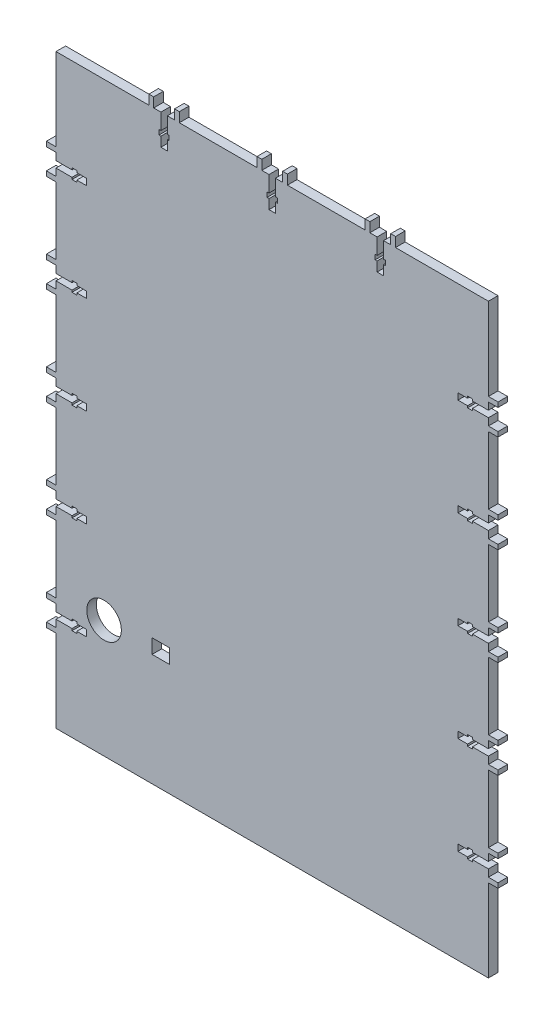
from build123d import *

# Parameters (mm, degrees)
SKETCH1_W               = 270
SKETCH1_H               = 366
BOSS_EXTRUDE1_DEPTH     = 6
SKETCH2_R               = 10.8
SKETCH2_W               = 11
SKETCH2_H               = 9
CUT_EXTRUDE1_DEPTH      = 228.486263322
CUT_EXTRUDE2_DEPTH      = 228.486263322
SKETCH4_W               = 3
SKETCH4_H               = 6
BOSS_EXTRUDE2_DEPTH     = 6
LPATTERN1_COUNT         = 3
LPATTERN1_PITCH         = 67.5
CUT_EXTRUDE3_DEPTH      = 233.340267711
SKETCH6_W               = 6
SKETCH6_H               = 3
BOSS_EXTRUDE3_DEPTH     = 6
LPATTERN2_COUNT         = 5
LPATTERN2_PITCH         = 61
MIRROR1_COPY_1_DEPTH    = 233.340267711
MIRROR1_COPY_2_DEPTH    = 233.340267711
MIRROR1_COPY_3_DEPTH    = 233.340267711
MIRROR1_COPY_4_DEPTH    = 233.340267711
MIRROR1_COPY_5_SKETCH_W = 6
MIRROR1_COPY_5_SKETCH_H = 3
MIRROR1_COPY_5_DEPTH    = 6
MIRROR1_COPY_6_SKETCH_W = 6
MIRROR1_COPY_6_SKETCH_H = 3
MIRROR1_COPY_6_DEPTH    = 6
MIRROR1_COPY_7_SKETCH_W = 6
MIRROR1_COPY_7_SKETCH_H = 3
MIRROR1_COPY_7_DEPTH    = 6
MIRROR1_COPY_8_SKETCH_W = 6
MIRROR1_COPY_8_SKETCH_H = 3
MIRROR1_COPY_8_DEPTH    = 6


with BuildPart() as part:
    # Sketch1 → Boss-Extrude1 (new body)
    with BuildSketch(Plane.XY):
        Rectangle(SKETCH1_W, SKETCH1_H)
    extrude(amount=BOSS_EXTRUDE1_DEPTH)

    # Sketch2 → Cut-Extrude1 (cut, through all)
    with BuildSketch(Plane.XY.offset(6)):
        with Locations((-105, -109.5)):
            Circle(SKETCH2_R)
        with Locations((-69.5, -108.5)):
            Rectangle(SKETCH2_W, SKETCH2_H)
    extrude(amount=-CUT_EXTRUDE1_DEPTH, mode=Mode.SUBTRACT)

    # Sketch3 → Cut-Extrude2 (cut, through all)
    with BuildSketch(Plane.XY.offset(6)):
        Polygon((-69.5, 183), (-69.5, 173), (-70.7, 173), (-70.7, 170), (-69.5, 170), (-69.5, 164), (-65.5, 164), (-65.5, 170), (-64.3, 170), (-64.3, 173), (-65.5, 173), (-65.5, 183), align=None)
    cut_extrude2 = extrude(amount=-CUT_EXTRUDE2_DEPTH, mode=Mode.SUBTRACT)

    # Sketch4 → Boss-Extrude2 (add, through all)
    with BuildSketch(Plane.XY.offset(6)):
        with Locations((-75.5, 186)):
            Rectangle(SKETCH4_W, SKETCH4_H)
        with Locations((-59.5, 186)):
            Rectangle(SKETCH4_W, SKETCH4_H)
    boss_extrude2 = extrude(amount=-BOSS_EXTRUDE2_DEPTH)

    # LPattern1: Cut-Extrude2, Boss-Extrude2 ×3
    with Locations(*[(i * LPATTERN1_PITCH, 0, 0) for i in range(1, LPATTERN1_COUNT)]):
        add(cut_extrude2, mode=Mode.SUBTRACT)
        add(boss_extrude2)

    # Sketch5 → Cut-Extrude3 (cut, through all)
    with BuildSketch(Plane.XY.offset(6)):
        Polygon((-135, 124), (-125, 124), (-125, 125.2), (-122, 125.2), (-122, 124), (-116, 124), (-116, 120), (-122, 120), (-122, 118.8), (-125, 118.8), (-125, 120), (-135, 120), align=None)
    cut_extrude3 = extrude(amount=-CUT_EXTRUDE3_DEPTH, mode=Mode.SUBTRACT)

    # Sketch6 → Boss-Extrude3 (add, through all)
    with BuildSketch(Plane.XY.offset(6)):
        with Locations((-138, 130)):
            Rectangle(SKETCH6_W, SKETCH6_H)
        with Locations((-138, 114)):
            Rectangle(SKETCH6_W, SKETCH6_H)
    boss_extrude3 = extrude(amount=-BOSS_EXTRUDE3_DEPTH)

    # LPattern2: Cut-Extrude3, Boss-Extrude3 ×5
    with Locations(*[(0, -i * LPATTERN2_PITCH, 0) for i in range(1, LPATTERN2_COUNT)]):
        add(cut_extrude3, mode=Mode.SUBTRACT)
        add(boss_extrude3)

    # Mirror1: Cut-Extrude3, Boss-Extrude3 across plane
    add(cut_extrude3.mirror(Plane(origin=(0, 0, 0), x_dir=(0, 0, 1), z_dir=(1, 0, 0))), mode=Mode.SUBTRACT)
    add(boss_extrude3.mirror(Plane(origin=(0, 0, 0), x_dir=(0, 0, 1), z_dir=(1, 0, 0))))

    # Mirror1 copy 1 sketch → Mirror1 copy 1 (cut, through all)
    with BuildSketch(Plane(origin=(0, -61, 6), x_dir=(-1, 0, 0), z_dir=(0, 0, 1))):
        Polygon((-135, -124), (-125, -124), (-125, -125.2), (-122, -125.2), (-122, -124), (-116, -124), (-116, -120), (-122, -120), (-122, -118.8), (-125, -118.8), (-125, -120), (-135, -120), align=None)
    extrude(amount=-MIRROR1_COPY_1_DEPTH, mode=Mode.SUBTRACT)

    # Mirror1 copy 2 sketch → Mirror1 copy 2 (cut, through all)
    with BuildSketch(Plane(origin=(0, -122, 6), x_dir=(-1, 0, 0), z_dir=(0, 0, 1))):
        Polygon((-135, -124), (-125, -124), (-125, -125.2), (-122, -125.2), (-122, -124), (-116, -124), (-116, -120), (-122, -120), (-122, -118.8), (-125, -118.8), (-125, -120), (-135, -120), align=None)
    extrude(amount=-MIRROR1_COPY_2_DEPTH, mode=Mode.SUBTRACT)

    # Mirror1 copy 3 sketch → Mirror1 copy 3 (cut, through all)
    with BuildSketch(Plane(origin=(0, -183, 6), x_dir=(-1, 0, 0), z_dir=(0, 0, 1))):
        Polygon((-135, -124), (-125, -124), (-125, -125.2), (-122, -125.2), (-122, -124), (-116, -124), (-116, -120), (-122, -120), (-122, -118.8), (-125, -118.8), (-125, -120), (-135, -120), align=None)
    extrude(amount=-MIRROR1_COPY_3_DEPTH, mode=Mode.SUBTRACT)

    # Mirror1 copy 4 sketch → Mirror1 copy 4 (cut, through all)
    with BuildSketch(Plane(origin=(0, -244, 6), x_dir=(-1, 0, 0), z_dir=(0, 0, 1))):
        Polygon((-135, -124), (-125, -124), (-125, -125.2), (-122, -125.2), (-122, -124), (-116, -124), (-116, -120), (-122, -120), (-122, -118.8), (-125, -118.8), (-125, -120), (-135, -120), align=None)
    extrude(amount=-MIRROR1_COPY_4_DEPTH, mode=Mode.SUBTRACT)

    # Mirror1 copy 5 sketch → Mirror1 copy 5 (add, through all)
    with BuildSketch(Plane(origin=(0, -61, 6), x_dir=(-1, 0, 0), z_dir=(0, 0, 1))):
        with Locations((-138, -130)):
            Rectangle(MIRROR1_COPY_5_SKETCH_W, MIRROR1_COPY_5_SKETCH_H)
        with Locations((-138, -114)):
            Rectangle(MIRROR1_COPY_5_SKETCH_W, MIRROR1_COPY_5_SKETCH_H)
    extrude(amount=-MIRROR1_COPY_5_DEPTH)

    # Mirror1 copy 6 sketch → Mirror1 copy 6 (add, through all)
    with BuildSketch(Plane(origin=(0, -122, 6), x_dir=(-1, 0, 0), z_dir=(0, 0, 1))):
        with Locations((-138, -130)):
            Rectangle(MIRROR1_COPY_6_SKETCH_W, MIRROR1_COPY_6_SKETCH_H)
        with Locations((-138, -114)):
            Rectangle(MIRROR1_COPY_6_SKETCH_W, MIRROR1_COPY_6_SKETCH_H)
    extrude(amount=-MIRROR1_COPY_6_DEPTH)

    # Mirror1 copy 7 sketch → Mirror1 copy 7 (add, through all)
    with BuildSketch(Plane(origin=(0, -183, 6), x_dir=(-1, 0, 0), z_dir=(0, 0, 1))):
        with Locations((-138, -130)):
            Rectangle(MIRROR1_COPY_7_SKETCH_W, MIRROR1_COPY_7_SKETCH_H)
        with Locations((-138, -114)):
            Rectangle(MIRROR1_COPY_7_SKETCH_W, MIRROR1_COPY_7_SKETCH_H)
    extrude(amount=-MIRROR1_COPY_7_DEPTH)

    # Mirror1 copy 8 sketch → Mirror1 copy 8 (add, through all)
    with BuildSketch(Plane(origin=(0, -244, 6), x_dir=(-1, 0, 0), z_dir=(0, 0, 1))):
        with Locations((-138, -130)):
            Rectangle(MIRROR1_COPY_8_SKETCH_W, MIRROR1_COPY_8_SKETCH_H)
        with Locations((-138, -114)):
            Rectangle(MIRROR1_COPY_8_SKETCH_W, MIRROR1_COPY_8_SKETCH_H)
    extrude(amount=-MIRROR1_COPY_8_DEPTH)


solid = part.part
